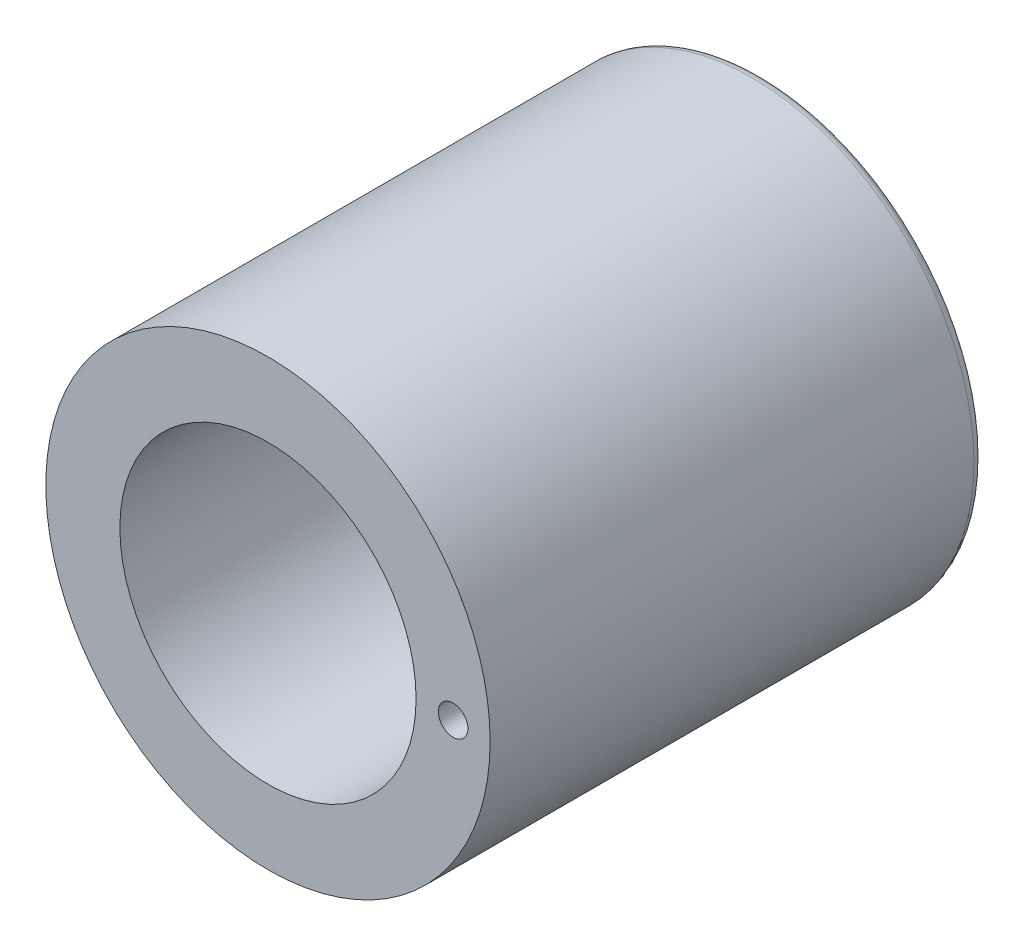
from build123d import *

# Parameters (mm, degrees)
ESQUISSE1_R             = 45
BASE_EXTRUSION_DEPTH    = 100
ESQUISSE2_R             = 30
ENL_V_MAT_EXTRU_1_DEPTH = 100
ESQUISSE3_R             = 3
ENL_V_MAT_EXTRU_2_DEPTH = 30
CONG_1_R                = 2


with BuildPart() as part:
    # Esquisse1 → Base-Extrusion (new body)
    with BuildSketch(Plane.XY):
        Circle(ESQUISSE1_R)
    extrude(amount=BASE_EXTRUSION_DEPTH)

    # Esquisse2 → Enl_v. mat.-Extru.1 (cut)
    with BuildSketch(Plane.XY.offset(100)):
        Circle(ESQUISSE2_R)
    extrude(amount=-ENL_V_MAT_EXTRU_1_DEPTH, mode=Mode.SUBTRACT)

    # Esquisse3 → Enl_v. mat.-Extru.2 (cut)
    with BuildSketch(Plane.XY.offset(100)):
        with Locations((37.5, 0)):
            Circle(ESQUISSE3_R)
    extrude(amount=-ENL_V_MAT_EXTRU_2_DEPTH, mode=Mode.SUBTRACT)

    # Cong_1
    cong_1_edges = [part.edges().sort_by_distance(p)[0] for p in [
        (-45, 0, 0),
    ]]
    fillet(cong_1_edges, radius=CONG_1_R)


solid = part.part
